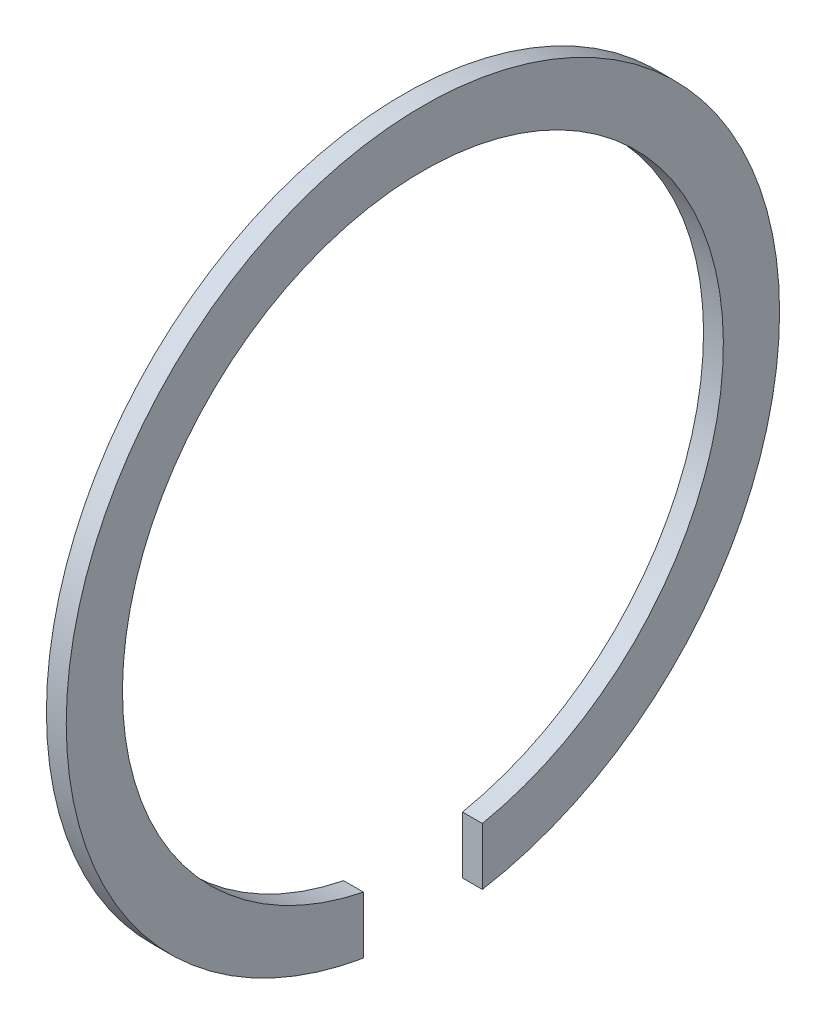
ISO-10303-21;
HEADER;
FILE_DESCRIPTION(('STEP AP214'),'2;1');
FILE_NAME('part.step','',(''),(''),'','','');
FILE_SCHEMA(('AUTOMOTIVE_DESIGN { 1 0 10303 214 1 1 1 1 }'));
ENDSEC;
DATA;
#1=APPLICATION_CONTEXT('core data for automotive mechanical design processes');
#2=APPLICATION_PROTOCOL_DEFINITION('international standard','automotive_design',2000,#1);
#3=PRODUCT_CONTEXT('',#1,'mechanical');
#4=PRODUCT('Part','Part','',(#3));
#5=PRODUCT_RELATED_PRODUCT_CATEGORY('part','',(#4));
#6=PRODUCT_DEFINITION_FORMATION('','',#4);
#7=PRODUCT_DEFINITION_CONTEXT('part definition',#1,'design');
#8=PRODUCT_DEFINITION('design','',#6,#7);
#9=PRODUCT_DEFINITION_SHAPE('','',#8);
#10=(LENGTH_UNIT() NAMED_UNIT(*) SI_UNIT(.MILLI.,.METRE.));
#11=(NAMED_UNIT(*) PLANE_ANGLE_UNIT() SI_UNIT($,.RADIAN.));
#12=(NAMED_UNIT(*) SI_UNIT($,.STERADIAN.) SOLID_ANGLE_UNIT());
#13=UNCERTAINTY_MEASURE_WITH_UNIT(LENGTH_MEASURE(1.E-05),#10,'distance_accuracy_value','');
#14=(GEOMETRIC_REPRESENTATION_CONTEXT(3) GLOBAL_UNCERTAINTY_ASSIGNED_CONTEXT((#13)) GLOBAL_UNIT_ASSIGNED_CONTEXT((#10,
#11,#12)) REPRESENTATION_CONTEXT('',''));
#15=CARTESIAN_POINT('',(0.,0.,0.));
#16=DIRECTION('',(0.,0.,1.));
#17=DIRECTION('',(1.,0.,0.));
#18=AXIS2_PLACEMENT_3D('',#15,#16,#17);
#19=CARTESIAN_POINT('',(-4.,72.,0.));
#20=DIRECTION('',(-1.,0.,0.));
#21=DIRECTION('',(0.,0.,1.));
#22=AXIS2_PLACEMENT_3D('',#19,#20,#21);
#23=PLANE('',#22);
#24=DIRECTION('',(0.,-1.,0.));
#25=VECTOR('',#24,1.);
#26=CARTESIAN_POINT('',(-4.,-0.310413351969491,12.));
#27=LINE('',#26,#25);
#28=CARTESIAN_POINT('',(-4.,-59.4510092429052,12.));
#29=VERTEX_POINT('',#28);
#30=CARTESIAN_POINT('',(-4.,-70.9929573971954,12.));
#31=VERTEX_POINT('',#30);
#32=EDGE_CURVE('E72',#29,#31,#27,.T.);
#33=ORIENTED_EDGE('',*,*,#32,.T.);
#34=CARTESIAN_POINT('',(-4.,0.,0.));
#35=DIRECTION('',(1.,0.,0.));
#36=DIRECTION('',(0.,0.,-1.));
#37=AXIS2_PLACEMENT_3D('',#34,#35,#36);
#38=CIRCLE('',#37,72.);
#39=CARTESIAN_POINT('',(-4.,-70.9929573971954,-12.));
#40=VERTEX_POINT('',#39);
#41=EDGE_CURVE('E77',#40,#31,#38,.T.);
#42=ORIENTED_EDGE('',*,*,#41,.F.);
#43=DIRECTION('',(0.,1.,0.));
#44=VECTOR('',#43,1.);
#45=CARTESIAN_POINT('',(-4.,-0.310413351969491,-12.));
#46=LINE('',#45,#44);
#47=CARTESIAN_POINT('',(-4.,-59.4510092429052,-12.));
#48=VERTEX_POINT('',#47);
#49=EDGE_CURVE('E53',#40,#48,#46,.T.);
#50=ORIENTED_EDGE('',*,*,#49,.T.);
#51=CARTESIAN_POINT('',(-4.,0.,0.));
#52=DIRECTION('',(1.,0.,0.));
#53=DIRECTION('',(0.,0.,-1.));
#54=AXIS2_PLACEMENT_3D('',#51,#52,#53);
#55=CIRCLE('',#54,60.65);
#56=EDGE_CURVE('E92',#48,#29,#55,.T.);
#57=ORIENTED_EDGE('',*,*,#56,.T.);
#58=EDGE_LOOP('',(#33,#42,#50,#57));
#59=FACE_BOUND('',#58,.T.);
#60=ADVANCED_FACE('F32',(#59),#23,.T.);
#61=CARTESIAN_POINT('',(0.,0.,0.));
#62=DIRECTION('',(1.,0.,0.));
#63=DIRECTION('',(0.,0.,-1.));
#64=AXIS2_PLACEMENT_3D('',#61,#62,#63);
#65=CYLINDRICAL_SURFACE('',#64,60.65);
#66=DIRECTION('',(1.,0.,0.));
#67=VECTOR('',#66,1.);
#68=CARTESIAN_POINT('',(0.,-59.4510092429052,12.));
#69=LINE('',#68,#67);
#70=CARTESIAN_POINT('',(0.,-59.4510092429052,12.));
#71=VERTEX_POINT('',#70);
#72=EDGE_CURVE('E69',#29,#71,#69,.T.);
#73=ORIENTED_EDGE('',*,*,#72,.F.);
#74=ORIENTED_EDGE('',*,*,#56,.F.);
#75=DIRECTION('',(1.,0.,0.));
#76=VECTOR('',#75,1.);
#77=CARTESIAN_POINT('',(0.,-59.4510092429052,-12.));
#78=LINE('',#77,#76);
#79=CARTESIAN_POINT('',(0.,-59.4510092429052,-12.));
#80=VERTEX_POINT('',#79);
#81=EDGE_CURVE('E78',#80,#48,#78,.F.);
#82=ORIENTED_EDGE('',*,*,#81,.F.);
#83=CARTESIAN_POINT('',(0.,0.,0.));
#84=DIRECTION('',(1.,0.,0.));
#85=DIRECTION('',(0.,0.,-1.));
#86=AXIS2_PLACEMENT_3D('',#83,#84,#85);
#87=CIRCLE('',#86,60.65);
#88=EDGE_CURVE('E85',#80,#71,#87,.T.);
#89=ORIENTED_EDGE('',*,*,#88,.T.);
#90=EDGE_LOOP('',(#73,#74,#82,#89));
#91=FACE_BOUND('',#90,.T.);
#92=ADVANCED_FACE('F91',(#91),#65,.F.);
#93=CARTESIAN_POINT('',(0.,72.,0.));
#94=DIRECTION('',(1.,0.,0.));
#95=DIRECTION('',(0.,0.,-1.));
#96=AXIS2_PLACEMENT_3D('',#93,#94,#95);
#97=PLANE('',#96);
#98=DIRECTION('',(0.,-1.,0.));
#99=VECTOR('',#98,1.);
#100=CARTESIAN_POINT('',(0.,-0.310413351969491,12.));
#101=LINE('',#100,#99);
#102=CARTESIAN_POINT('',(0.,-70.9929573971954,12.));
#103=VERTEX_POINT('',#102);
#104=EDGE_CURVE('E45',#71,#103,#101,.T.);
#105=ORIENTED_EDGE('',*,*,#104,.F.);
#106=ORIENTED_EDGE('',*,*,#88,.F.);
#107=DIRECTION('',(0.,1.,0.));
#108=VECTOR('',#107,1.);
#109=CARTESIAN_POINT('',(0.,-0.310413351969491,-12.));
#110=LINE('',#109,#108);
#111=CARTESIAN_POINT('',(0.,-70.9929573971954,-12.));
#112=VERTEX_POINT('',#111);
#113=EDGE_CURVE('E88',#112,#80,#110,.T.);
#114=ORIENTED_EDGE('',*,*,#113,.F.);
#115=CARTESIAN_POINT('',(0.,0.,0.));
#116=DIRECTION('',(1.,0.,0.));
#117=DIRECTION('',(0.,0.,-1.));
#118=AXIS2_PLACEMENT_3D('',#115,#116,#117);
#119=CIRCLE('',#118,72.);
#120=EDGE_CURVE('E87',#112,#103,#119,.T.);
#121=ORIENTED_EDGE('',*,*,#120,.T.);
#122=EDGE_LOOP('',(#105,#106,#114,#121));
#123=FACE_BOUND('',#122,.T.);
#124=ADVANCED_FACE('F83',(#123),#97,.T.);
#125=CARTESIAN_POINT('',(0.,0.,0.));
#126=DIRECTION('',(1.,0.,0.));
#127=DIRECTION('',(0.,0.,-1.));
#128=AXIS2_PLACEMENT_3D('',#125,#126,#127);
#129=CYLINDRICAL_SURFACE('',#128,72.);
#130=DIRECTION('',(1.,0.,0.));
#131=VECTOR('',#130,1.);
#132=CARTESIAN_POINT('',(0.,-70.9929573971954,12.));
#133=LINE('',#132,#131);
#134=EDGE_CURVE('E11',#103,#31,#133,.F.);
#135=ORIENTED_EDGE('',*,*,#134,.F.);
#136=ORIENTED_EDGE('',*,*,#120,.F.);
#137=DIRECTION('',(1.,0.,0.));
#138=VECTOR('',#137,1.);
#139=CARTESIAN_POINT('',(0.,-70.9929573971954,-12.));
#140=LINE('',#139,#138);
#141=EDGE_CURVE('E39',#40,#112,#140,.T.);
#142=ORIENTED_EDGE('',*,*,#141,.F.);
#143=ORIENTED_EDGE('',*,*,#41,.T.);
#144=EDGE_LOOP('',(#135,#136,#142,#143));
#145=FACE_BOUND('',#144,.T.);
#146=ADVANCED_FACE('F102',(#145),#129,.T.);
#147=CARTESIAN_POINT('',(-4.,-0.310413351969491,-12.));
#148=DIRECTION('',(0.,0.,-1.));
#149=DIRECTION('',(0.,1.,0.));
#150=AXIS2_PLACEMENT_3D('',#147,#148,#149);
#151=PLANE('',#150);
#152=ORIENTED_EDGE('',*,*,#81,.T.);
#153=ORIENTED_EDGE('',*,*,#49,.F.);
#154=ORIENTED_EDGE('',*,*,#141,.T.);
#155=ORIENTED_EDGE('',*,*,#113,.T.);
#156=EDGE_LOOP('',(#152,#153,#154,#155));
#157=FACE_BOUND('',#156,.T.);
#158=ADVANCED_FACE('F97',(#157),#151,.F.);
#159=CARTESIAN_POINT('',(-4.,-0.310413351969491,12.));
#160=DIRECTION('',(0.,0.,1.));
#161=DIRECTION('',(0.,-1.,0.));
#162=AXIS2_PLACEMENT_3D('',#159,#160,#161);
#163=PLANE('',#162);
#164=ORIENTED_EDGE('',*,*,#72,.T.);
#165=ORIENTED_EDGE('',*,*,#104,.T.);
#166=ORIENTED_EDGE('',*,*,#134,.T.);
#167=ORIENTED_EDGE('',*,*,#32,.F.);
#168=EDGE_LOOP('',(#164,#165,#166,#167));
#169=FACE_BOUND('',#168,.T.);
#170=ADVANCED_FACE('F70',(#169),#163,.F.);
#171=CLOSED_SHELL('',(#60,#92,#124,#146,#158,#170));
#172=MANIFOLD_SOLID_BREP('B2',#171);
#173=ADVANCED_BREP_SHAPE_REPRESENTATION('',(#18,#172),#14);
#174=SHAPE_DEFINITION_REPRESENTATION(#9,#173);
ENDSEC;
END-ISO-10303-21;
